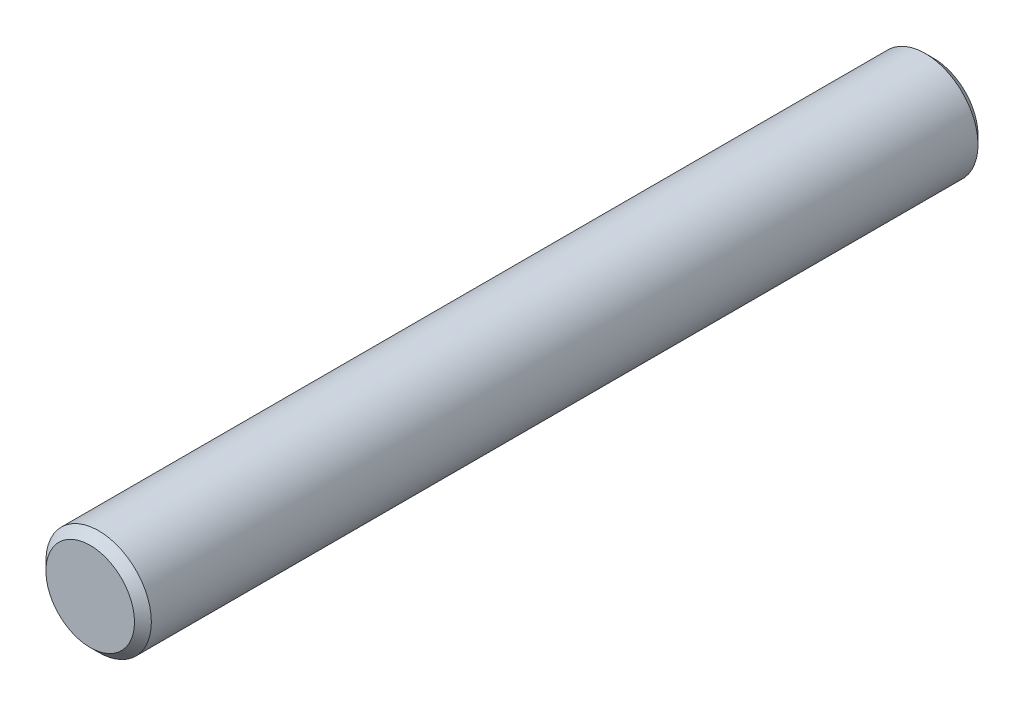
from build123d import *

# Parameters (mm, degrees)
SKETCH1_R           = 1.5875
BOSS_EXTRUDE1_DEPTH = 25.4
CHAMFER1_SIZE       = 0.254


with BuildPart() as part:
    # Sketch1 → Boss-Extrude1 (new body)
    with BuildSketch(Plane.XY):
        Circle(SKETCH1_R)
    extrude(amount=BOSS_EXTRUDE1_DEPTH)

    # Chamfer1
    chamfer1_edges = [part.edges().sort_by_distance(p)[0] for p in [
        (-1.5875, 0, 0),
        (-1.5875, 0, 25.4),
    ]]
    chamfer(chamfer1_edges, length=CHAMFER1_SIZE)


solid = part.part
